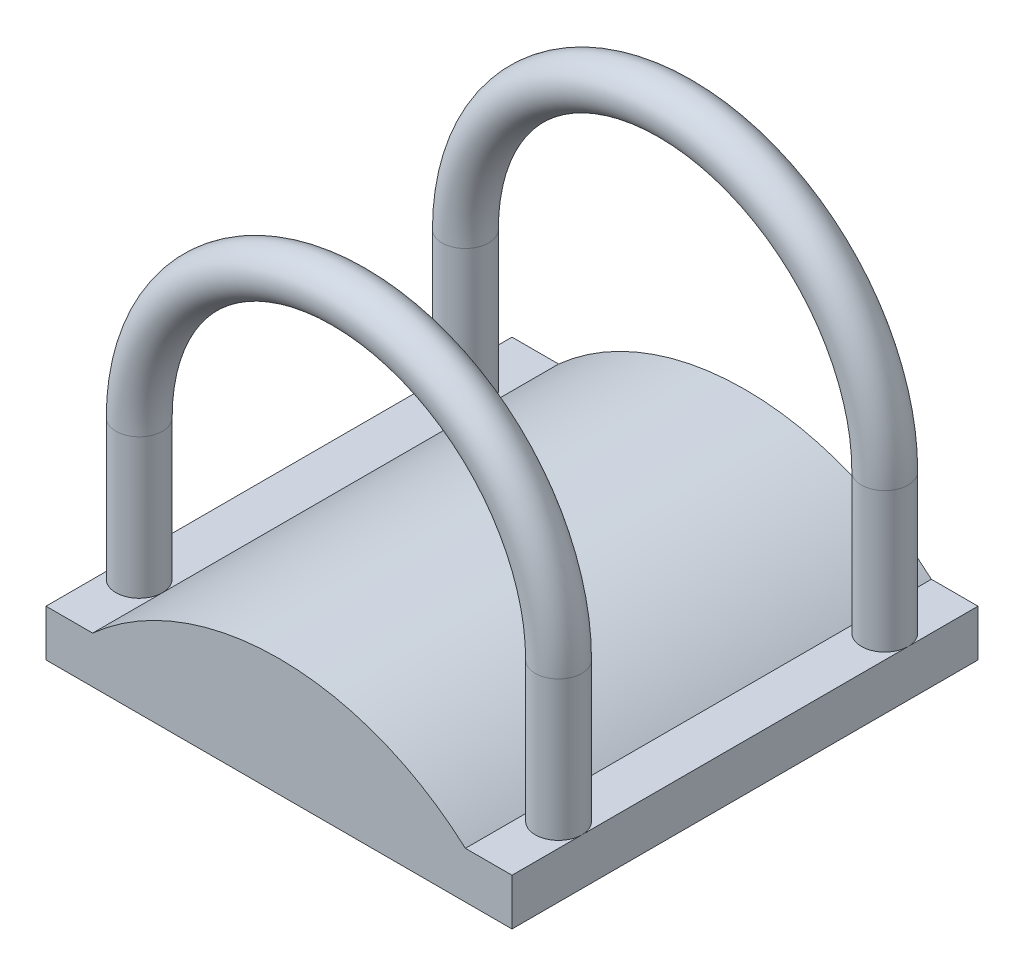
from build123d import *

# Parameters (mm, degrees)
EXTRUDE1_DEPTH = 50
SKETCH3_R      = 5


with BuildPart() as part:
    # Sketch1 → Extrude1 (new, symmetric)
    with BuildSketch(Plane.XY):
        with BuildLine():
            Line((0, 0), (-100, 0))
            Line((-100, 0), (-100, 10))
            Line((-100, 10), (-90, 10))
            ThreePointArc((-90, 10), (-50, 25.27864045), (-10, 10))
            Line((-10, 10), (0, 10))
            Line((0, 10), (0, 0))
        make_face()
    extrude(amount=EXTRUDE1_DEPTH, both=True)

    # Sweep1: sweep along a path in Sketch2
    with BuildLine(Plane.XY) as sweep1_path:
        Line((-95, 10), (-95, 40))
        ThreePointArc((-95, 40), (-50, 85), (-5, 40))
        Line((-5, 40), (-5, 10))
    # Sketch3 → Sweep1 (sweep)
    with BuildSketch(Plane(origin=(0, 10, 0), x_dir=(-1, 0, 0), z_dir=(0, 1, 0))):
        with Locations((5, 35)):
            Circle(SKETCH3_R)
        with Locations((5, -35)):
            Circle(SKETCH3_R)
    sweep(path=sweep1_path.line)


solid = part.part
